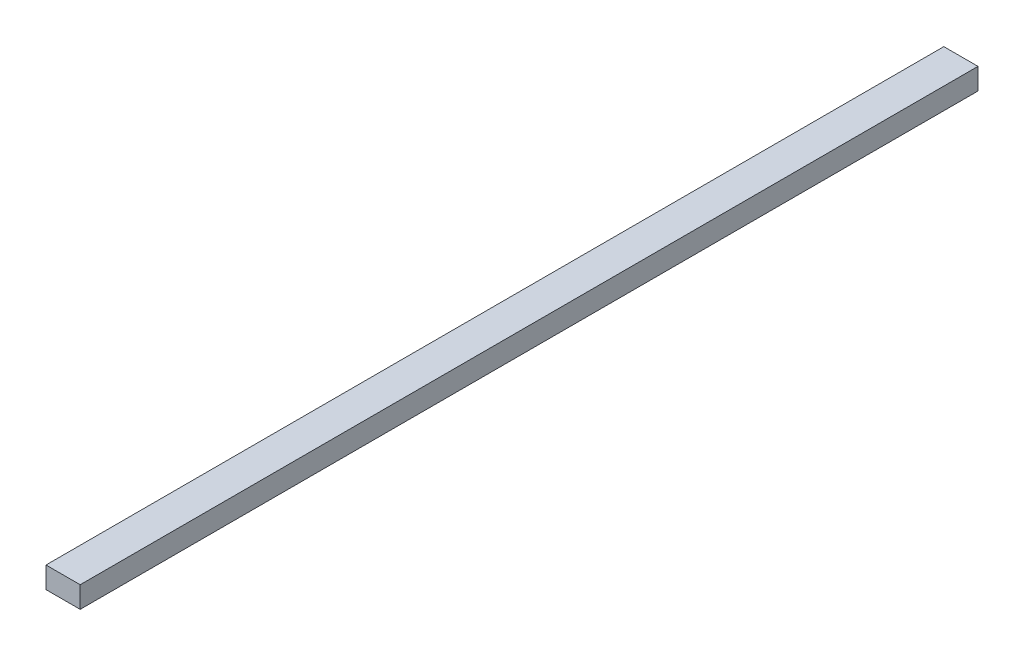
ISO-10303-21;
HEADER;
FILE_DESCRIPTION(('STEP AP214'),'2;1');
FILE_NAME('part.step','',(''),(''),'','','');
FILE_SCHEMA(('AUTOMOTIVE_DESIGN { 1 0 10303 214 1 1 1 1 }'));
ENDSEC;
DATA;
#1=APPLICATION_CONTEXT('core data for automotive mechanical design processes');
#2=APPLICATION_PROTOCOL_DEFINITION('international standard','automotive_design',2000,#1);
#3=PRODUCT_CONTEXT('',#1,'mechanical');
#4=PRODUCT('Part','Part','',(#3));
#5=PRODUCT_RELATED_PRODUCT_CATEGORY('part','',(#4));
#6=PRODUCT_DEFINITION_FORMATION('','',#4);
#7=PRODUCT_DEFINITION_CONTEXT('part definition',#1,'design');
#8=PRODUCT_DEFINITION('design','',#6,#7);
#9=PRODUCT_DEFINITION_SHAPE('','',#8);
#10=(LENGTH_UNIT() NAMED_UNIT(*) SI_UNIT(.MILLI.,.METRE.));
#11=(NAMED_UNIT(*) PLANE_ANGLE_UNIT() SI_UNIT($,.RADIAN.));
#12=(NAMED_UNIT(*) SI_UNIT($,.STERADIAN.) SOLID_ANGLE_UNIT());
#13=UNCERTAINTY_MEASURE_WITH_UNIT(LENGTH_MEASURE(1.E-05),#10,'distance_accuracy_value','');
#14=(GEOMETRIC_REPRESENTATION_CONTEXT(3) GLOBAL_UNCERTAINTY_ASSIGNED_CONTEXT((#13)) GLOBAL_UNIT_ASSIGNED_CONTEXT((#10,
#11,#12)) REPRESENTATION_CONTEXT('',''));
#15=CARTESIAN_POINT('',(0.,0.,0.));
#16=DIRECTION('',(0.,0.,1.));
#17=DIRECTION('',(1.,0.,0.));
#18=AXIS2_PLACEMENT_3D('',#15,#16,#17);
#19=CARTESIAN_POINT('',(-41.0796013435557,12.5143156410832,667.40024));
#20=DIRECTION('',(1.,0.,0.));
#21=DIRECTION('',(0.,0.,-1.));
#22=AXIS2_PLACEMENT_3D('',#19,#20,#21);
#23=PLANE('',#22);
#24=DIRECTION('',(0.,-1.,0.));
#25=VECTOR('',#24,1.);
#26=CARTESIAN_POINT('',(-41.0796013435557,12.5143156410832,0.));
#27=LINE('',#26,#25);
#28=CARTESIAN_POINT('',(-41.0796013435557,12.5143156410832,0.));
#29=VERTEX_POINT('',#28);
#30=CARTESIAN_POINT('',(-41.0796013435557,-3.36068435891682,0.));
#31=VERTEX_POINT('',#30);
#32=EDGE_CURVE('E94',#29,#31,#27,.T.);
#33=ORIENTED_EDGE('',*,*,#32,.T.);
#34=DIRECTION('',(0.,0.,-1.));
#35=VECTOR('',#34,1.);
#36=CARTESIAN_POINT('',(-41.0796013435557,-3.36068435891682,667.40024));
#37=LINE('',#36,#35);
#38=CARTESIAN_POINT('',(-41.0796013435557,-3.36068435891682,667.40024));
#39=VERTEX_POINT('',#38);
#40=EDGE_CURVE('E11',#39,#31,#37,.T.);
#41=ORIENTED_EDGE('',*,*,#40,.F.);
#42=DIRECTION('',(0.,-1.,0.));
#43=VECTOR('',#42,1.);
#44=CARTESIAN_POINT('',(-41.0796013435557,12.5143156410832,667.40024));
#45=LINE('',#44,#43);
#46=CARTESIAN_POINT('',(-41.0796013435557,12.5143156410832,667.40024));
#47=VERTEX_POINT('',#46);
#48=EDGE_CURVE('E82',#47,#39,#45,.T.);
#49=ORIENTED_EDGE('',*,*,#48,.F.);
#50=DIRECTION('',(0.,0.,-1.));
#51=VECTOR('',#50,1.);
#52=CARTESIAN_POINT('',(-41.0796013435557,12.5143156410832,667.40024));
#53=LINE('',#52,#51);
#54=EDGE_CURVE('E90',#47,#29,#53,.T.);
#55=ORIENTED_EDGE('',*,*,#54,.T.);
#56=EDGE_LOOP('',(#33,#41,#49,#55));
#57=FACE_BOUND('',#56,.T.);
#58=ADVANCED_FACE('F31',(#57),#23,.F.);
#59=CARTESIAN_POINT('',(-41.0796013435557,-3.36068435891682,667.40024));
#60=DIRECTION('',(0.,1.,0.));
#61=DIRECTION('',(0.,0.,1.));
#62=AXIS2_PLACEMENT_3D('',#59,#60,#61);
#63=PLANE('',#62);
#64=DIRECTION('',(1.,0.,0.));
#65=VECTOR('',#64,1.);
#66=CARTESIAN_POINT('',(-41.0796013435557,-3.36068435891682,0.));
#67=LINE('',#66,#65);
#68=CARTESIAN_POINT('',(-15.6796013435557,-3.36068435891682,0.));
#69=VERTEX_POINT('',#68);
#70=EDGE_CURVE('E86',#31,#69,#67,.T.);
#71=ORIENTED_EDGE('',*,*,#70,.T.);
#72=DIRECTION('',(0.,0.,-1.));
#73=VECTOR('',#72,1.);
#74=CARTESIAN_POINT('',(-15.6796013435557,-3.36068435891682,667.40024));
#75=LINE('',#74,#73);
#76=CARTESIAN_POINT('',(-15.6796013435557,-3.36068435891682,667.40024));
#77=VERTEX_POINT('',#76);
#78=EDGE_CURVE('E39',#77,#69,#75,.T.);
#79=ORIENTED_EDGE('',*,*,#78,.F.);
#80=DIRECTION('',(1.,0.,0.));
#81=VECTOR('',#80,1.);
#82=CARTESIAN_POINT('',(-41.0796013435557,-3.36068435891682,667.40024));
#83=LINE('',#82,#81);
#84=EDGE_CURVE('E77',#39,#77,#83,.T.);
#85=ORIENTED_EDGE('',*,*,#84,.F.);
#86=ORIENTED_EDGE('',*,*,#40,.T.);
#87=EDGE_LOOP('',(#71,#79,#85,#86));
#88=FACE_BOUND('',#87,.T.);
#89=ADVANCED_FACE('F85',(#88),#63,.F.);
#90=CARTESIAN_POINT('',(-15.6796013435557,12.5143156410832,667.40024));
#91=DIRECTION('',(-1.,0.,0.));
#92=DIRECTION('',(0.,-1.,0.));
#93=AXIS2_PLACEMENT_3D('',#90,#91,#92);
#94=PLANE('',#93);
#95=DIRECTION('',(0.,1.,0.));
#96=VECTOR('',#95,1.);
#97=CARTESIAN_POINT('',(-15.6796013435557,12.5143156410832,0.));
#98=LINE('',#97,#96);
#99=CARTESIAN_POINT('',(-15.6796013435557,12.5143156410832,0.));
#100=VERTEX_POINT('',#99);
#101=EDGE_CURVE('E64',#69,#100,#98,.T.);
#102=ORIENTED_EDGE('',*,*,#101,.T.);
#103=DIRECTION('',(0.,0.,-1.));
#104=VECTOR('',#103,1.);
#105=CARTESIAN_POINT('',(-15.6796013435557,12.5143156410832,667.40024));
#106=LINE('',#105,#104);
#107=CARTESIAN_POINT('',(-15.6796013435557,12.5143156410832,667.40024));
#108=VERTEX_POINT('',#107);
#109=EDGE_CURVE('E87',#108,#100,#106,.T.);
#110=ORIENTED_EDGE('',*,*,#109,.F.);
#111=DIRECTION('',(0.,1.,0.));
#112=VECTOR('',#111,1.);
#113=CARTESIAN_POINT('',(-15.6796013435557,12.5143156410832,667.40024));
#114=LINE('',#113,#112);
#115=EDGE_CURVE('E80',#77,#108,#114,.T.);
#116=ORIENTED_EDGE('',*,*,#115,.F.);
#117=ORIENTED_EDGE('',*,*,#78,.T.);
#118=EDGE_LOOP('',(#102,#110,#116,#117));
#119=FACE_BOUND('',#118,.T.);
#120=ADVANCED_FACE('F88',(#119),#94,.F.);
#121=CARTESIAN_POINT('',(-41.0796013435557,12.5143156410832,667.40024));
#122=DIRECTION('',(0.,-1.,0.));
#123=DIRECTION('',(0.,0.,-1.));
#124=AXIS2_PLACEMENT_3D('',#121,#122,#123);
#125=PLANE('',#124);
#126=DIRECTION('',(-1.,0.,0.));
#127=VECTOR('',#126,1.);
#128=CARTESIAN_POINT('',(-41.0796013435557,12.5143156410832,0.));
#129=LINE('',#128,#127);
#130=EDGE_CURVE('E70',#100,#29,#129,.T.);
#131=ORIENTED_EDGE('',*,*,#130,.T.);
#132=ORIENTED_EDGE('',*,*,#54,.F.);
#133=DIRECTION('',(-1.,0.,0.));
#134=VECTOR('',#133,1.);
#135=CARTESIAN_POINT('',(-41.0796013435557,12.5143156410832,667.40024));
#136=LINE('',#135,#134);
#137=EDGE_CURVE('E47',#108,#47,#136,.T.);
#138=ORIENTED_EDGE('',*,*,#137,.F.);
#139=ORIENTED_EDGE('',*,*,#109,.T.);
#140=EDGE_LOOP('',(#131,#132,#138,#139));
#141=FACE_BOUND('',#140,.T.);
#142=ADVANCED_FACE('F101',(#141),#125,.F.);
#143=CARTESIAN_POINT('',(-41.0796013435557,-3.36068435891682,667.40024));
#144=DIRECTION('',(0.,0.,1.));
#145=DIRECTION('',(1.,0.,0.));
#146=AXIS2_PLACEMENT_3D('',#143,#144,#145);
#147=PLANE('',#146);
#148=ORIENTED_EDGE('',*,*,#48,.T.);
#149=ORIENTED_EDGE('',*,*,#84,.T.);
#150=ORIENTED_EDGE('',*,*,#115,.T.);
#151=ORIENTED_EDGE('',*,*,#137,.T.);
#152=EDGE_LOOP('',(#148,#149,#150,#151));
#153=FACE_BOUND('',#152,.T.);
#154=ADVANCED_FACE('F78',(#153),#147,.T.);
#155=CARTESIAN_POINT('',(-41.0796013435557,-3.36068435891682,0.));
#156=DIRECTION('',(0.,0.,1.));
#157=DIRECTION('',(1.,0.,0.));
#158=AXIS2_PLACEMENT_3D('',#155,#156,#157);
#159=PLANE('',#158);
#160=ORIENTED_EDGE('',*,*,#32,.F.);
#161=ORIENTED_EDGE('',*,*,#130,.F.);
#162=ORIENTED_EDGE('',*,*,#101,.F.);
#163=ORIENTED_EDGE('',*,*,#70,.F.);
#164=EDGE_LOOP('',(#160,#161,#162,#163));
#165=FACE_BOUND('',#164,.T.);
#166=ADVANCED_FACE('F104',(#165),#159,.F.);
#167=CLOSED_SHELL('',(#58,#89,#120,#142,#154,#166));
#168=MANIFOLD_SOLID_BREP('B2',#167);
#169=ADVANCED_BREP_SHAPE_REPRESENTATION('',(#18,#168),#14);
#170=SHAPE_DEFINITION_REPRESENTATION(#9,#169);
ENDSEC;
END-ISO-10303-21;
